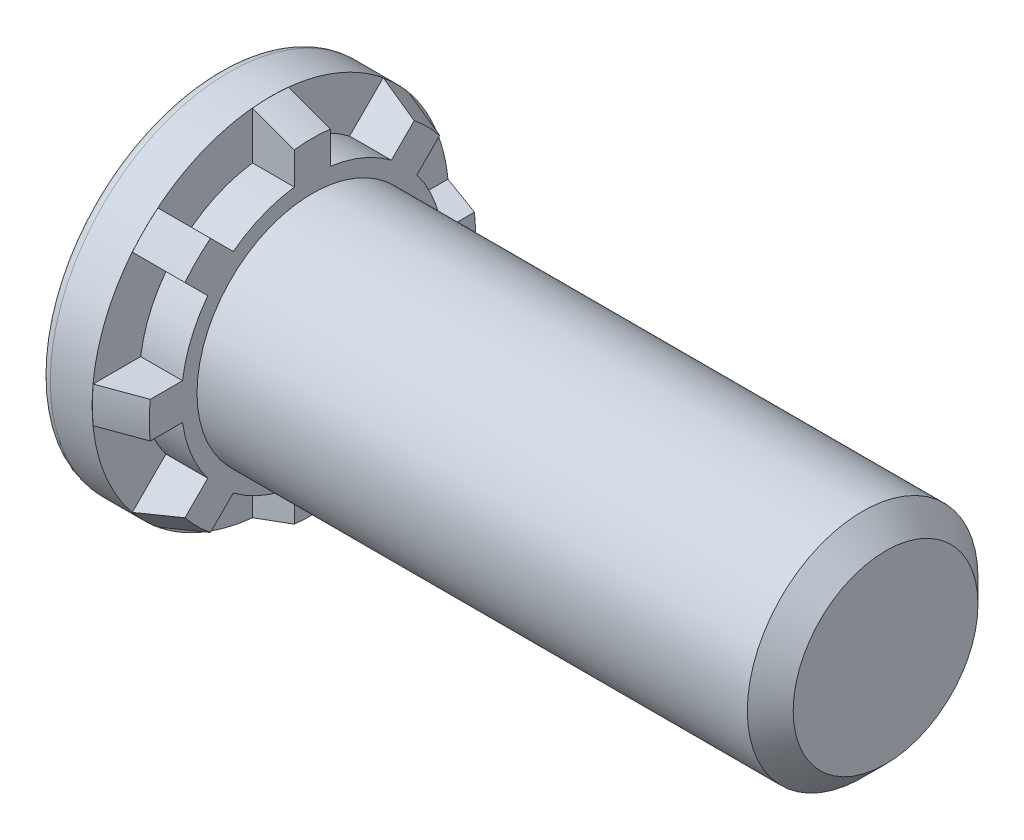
from build123d import *

# Parameters (mm, degrees)
RIBCUT_START     = -1.7272
RIBCUT_DEPTH     = 1.7272
RIBCUTSPAT_COUNT = 8
RIBCUTSPAT_ANGLE = 315


with BuildPart() as part:
    # BodySke → BaseBody (revolve)
    with BuildSketch(Plane.XY, mode=Mode.PRIVATE) as basebody_sk:
        with BuildLine():
            Line((-2.159, 6.9342), (-2.159, 0))
            Line((-2.159, 0), (25.4, 0))
            Line((25.4, 0), (25.4, 3.81635))
            Line((25.4, 3.81635), (24.45385, 4.7625))
            Line((24.45385, 4.7625), (1.7272, 4.7625))
            Line((1.7272, 4.7625), (1.7272, 6.735735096))
            Line((1.7272, 6.735735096), (0.00254, 7.36346))
            Line((0.00254, 7.36346), (0, 7.36346))
            Line((0, 7.36346), (0, 7.366))
            Line((0, 7.366), (-1.7272, 7.366))
            ThreePointArc((-1.7272, 7.366), (-2.032528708, 7.239528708), (-2.159, 6.9342))
        make_face()
    revolve(basebody_sk.sketch.rotate(Axis((0, 0, 0), (1, 0, 0)), 90), axis=Axis((0, 0, 0), (1, 0, 0)))

    # RibCutSke → RibCut (cut)
    with BuildSketch(Plane(origin=(1.7272, 1.794401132, -0.090952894), x_dir=(0, 0, -1), z_dir=(1, 0, 0)).offset(RIBCUT_START)):
        with BuildLine():
            Line((0.654066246, 3.567461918), (0.654066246, 5.533825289))
            ThreePointArc((0.654066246, 5.533825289), (2.727893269, 5.010895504), (4.564077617, 3.91424555))
            Line((4.564077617, 3.91424555), (3.173648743, 2.523816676))
            ThreePointArc((3.173648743, 2.523816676), (1.980656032, 3.206905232), (0.654066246, 3.567461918))
        make_face()
    ribcut = extrude(amount=RIBCUT_DEPTH, mode=Mode.SUBTRACT)

    # RibCutsPat: RibCut ×8 about axis
    ribcutspat_axis = Axis((0, 0, 0), (1, 0, 0))
    for i in range(1, RIBCUTSPAT_COUNT):
        add(ribcut.rotate(ribcutspat_axis, i * RIBCUTSPAT_ANGLE / (RIBCUTSPAT_COUNT - 1)), mode=Mode.SUBTRACT)


solid = part.part
